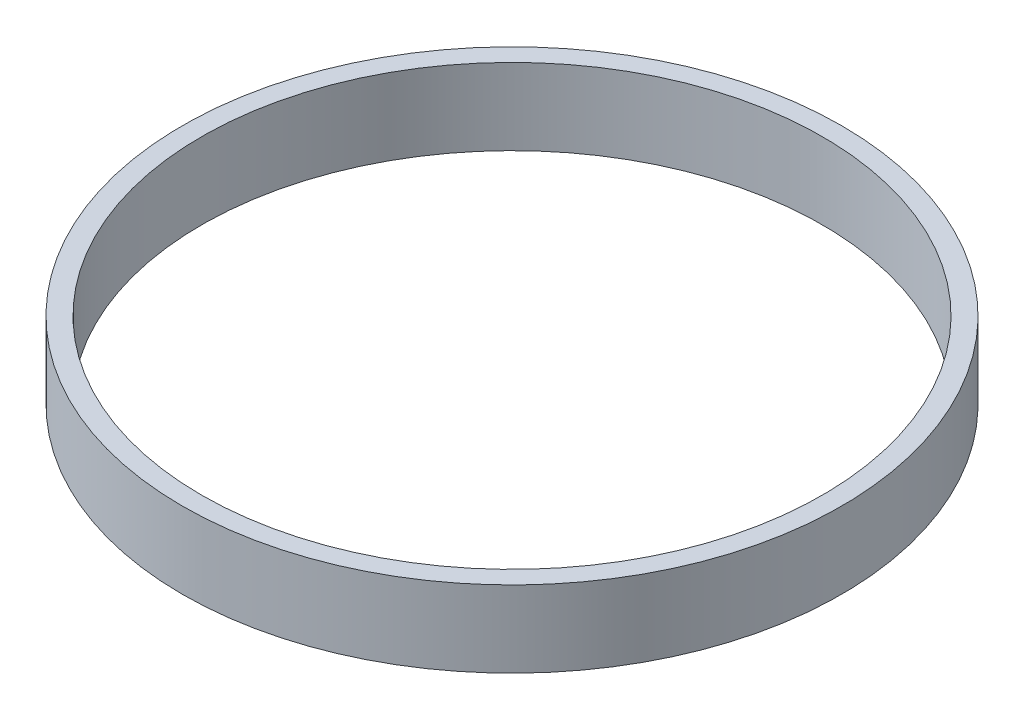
from build123d import *

# Parameters (mm, degrees)
SKETCH1_R           = 109.5375
SKETCH1_R_2         = 103.1875
BOSS_EXTRUDE1_DEPTH = 25.4


with BuildPart() as part:
    # Sketch1 → Boss-Extrude1 (new body)
    with BuildSketch(Plane(origin=(0, 0, 0), x_dir=(1, 0, 0), z_dir=(0, 1, 0))):
        with Locations(Location((0, 0, 0), (0, 0, 270))):
            Circle(SKETCH1_R)
        with Locations(Location((0, 0, 0), (0, 0, 270))):
            Circle(SKETCH1_R_2, mode=Mode.SUBTRACT)
    extrude(amount=BOSS_EXTRUDE1_DEPTH)


solid = part.part
